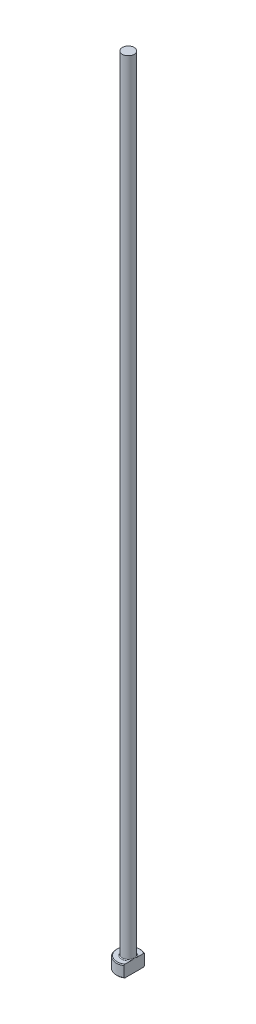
from build123d import *
from build123d.topology import SkipClean

# Parameters (mm, degrees)
CHAMFER1_SIZE = 0.2
FILLET1_R     = 0.2
KEY_DEPTH     = 201.044994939


with BuildPart() as part:
    # Sketch1 → Revolve1 (revolve)
    with BuildSketch(Plane.XY, mode=Mode.PRIVATE) as revolve1_sk:
        Polygon((0, 0), (-3, 0), (-3, 3), (-1.5, 3), (-1.5, 200), (0, 200), align=None)
    revolve(revolve1_sk.sketch.rotate(Axis((0, 259.958771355, 0), (0, -1, 0)), 270), axis=Axis((0, 259.958771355, 0), (0, -1, 0)))

    # Chamfer1
    chamfer1_edges = [part.edges().sort_by_distance(p)[0] for p in [
        (0, 3, -3),
        (0, 0, -3),
    ]]
    chamfer(chamfer1_edges, length=CHAMFER1_SIZE)

    # Fillet1
    fillet1_edges = [part.edges().sort_by_distance(p)[0] for p in [
        (0, 3, -1.5),
    ]]
    fillet(fillet1_edges, radius=FILLET1_R)

    # Sketch2 → KEY (cut, through all)
    with SkipClean():  # the faces are left unmerged after this step: merging them gives an invalid solid
        with BuildSketch(Plane(origin=(0, 0, 0), x_dir=(1, 0, 0), z_dir=(0, 1, 0))):
            with BuildLine():
                Line((1.5, 2.598076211), (1.5, -2.598076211))
                ThreePointArc((1.5, -2.598076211), (3, 0), (1.5, 2.598076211))
            make_face()
        extrude(amount=KEY_DEPTH, mode=Mode.SUBTRACT)


solid = part.part
